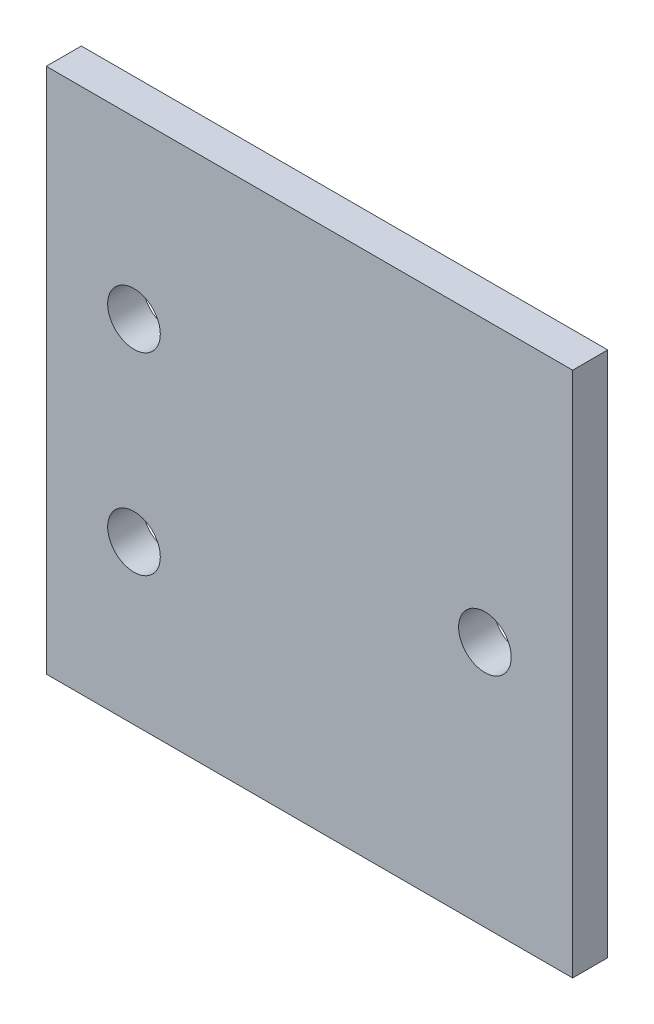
ISO-10303-21;
HEADER;
FILE_DESCRIPTION(('STEP AP214'),'2;1');
FILE_NAME('part.step','',(''),(''),'','','');
FILE_SCHEMA(('AUTOMOTIVE_DESIGN { 1 0 10303 214 1 1 1 1 }'));
ENDSEC;
DATA;
#1=APPLICATION_CONTEXT('core data for automotive mechanical design processes');
#2=APPLICATION_PROTOCOL_DEFINITION('international standard','automotive_design',2000,#1);
#3=PRODUCT_CONTEXT('',#1,'mechanical');
#4=PRODUCT('Part','Part','',(#3));
#5=PRODUCT_RELATED_PRODUCT_CATEGORY('part','',(#4));
#6=PRODUCT_DEFINITION_FORMATION('','',#4);
#7=PRODUCT_DEFINITION_CONTEXT('part definition',#1,'design');
#8=PRODUCT_DEFINITION('design','',#6,#7);
#9=PRODUCT_DEFINITION_SHAPE('','',#8);
#10=(LENGTH_UNIT() NAMED_UNIT(*) SI_UNIT(.MILLI.,.METRE.));
#11=(NAMED_UNIT(*) PLANE_ANGLE_UNIT() SI_UNIT($,.RADIAN.));
#12=(NAMED_UNIT(*) SI_UNIT($,.STERADIAN.) SOLID_ANGLE_UNIT());
#13=UNCERTAINTY_MEASURE_WITH_UNIT(LENGTH_MEASURE(1.E-05),#10,'distance_accuracy_value','');
#14=(GEOMETRIC_REPRESENTATION_CONTEXT(3) GLOBAL_UNCERTAINTY_ASSIGNED_CONTEXT((#13)) GLOBAL_UNIT_ASSIGNED_CONTEXT((#10,
#11,#12)) REPRESENTATION_CONTEXT('',''));
#15=CARTESIAN_POINT('',(0.,0.,0.));
#16=DIRECTION('',(0.,0.,1.));
#17=DIRECTION('',(1.,0.,0.));
#18=AXIS2_PLACEMENT_3D('',#15,#16,#17);
#19=CARTESIAN_POINT('',(0.,0.,2.));
#20=DIRECTION('',(0.,0.,1.));
#21=DIRECTION('',(1.,0.,0.));
#22=AXIS2_PLACEMENT_3D('',#19,#20,#21);
#23=PLANE('',#22);
#24=CARTESIAN_POINT('',(5.,-20.9721655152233,2.));
#25=DIRECTION('',(0.,0.,1.));
#26=DIRECTION('',(1.,0.,0.));
#27=AXIS2_PLACEMENT_3D('',#24,#25,#26);
#28=CIRCLE('',#27,1.5);
#29=CARTESIAN_POINT('',(6.5,-20.9721655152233,2.));
#30=VERTEX_POINT('',#29);
#31=EDGE_CURVE('E134',#30,#30,#28,.T.);
#32=ORIENTED_EDGE('',*,*,#31,.F.);
#33=EDGE_LOOP('',(#32));
#34=FACE_BOUND('',#33,.T.);
#35=DIRECTION('',(0.,-1.,0.));
#36=VECTOR('',#35,1.);
#37=CARTESIAN_POINT('',(0.,0.,2.));
#38=LINE('',#37,#36);
#39=CARTESIAN_POINT('',(0.,0.,2.));
#40=VERTEX_POINT('',#39);
#41=CARTESIAN_POINT('',(0.,-30.,2.));
#42=VERTEX_POINT('',#41);
#43=EDGE_CURVE('E92',#40,#42,#38,.T.);
#44=ORIENTED_EDGE('',*,*,#43,.T.);
#45=DIRECTION('',(1.,0.,0.));
#46=VECTOR('',#45,1.);
#47=CARTESIAN_POINT('',(0.,-30.,2.));
#48=LINE('',#47,#46);
#49=CARTESIAN_POINT('',(30.,-30.,2.));
#50=VERTEX_POINT('',#49);
#51=EDGE_CURVE('E87',#42,#50,#48,.T.);
#52=ORIENTED_EDGE('',*,*,#51,.T.);
#53=DIRECTION('',(0.,1.,0.));
#54=VECTOR('',#53,1.);
#55=CARTESIAN_POINT('',(30.,0.,2.));
#56=LINE('',#55,#54);
#57=CARTESIAN_POINT('',(30.,0.,2.));
#58=VERTEX_POINT('',#57);
#59=EDGE_CURVE('E90',#50,#58,#56,.T.);
#60=ORIENTED_EDGE('',*,*,#59,.T.);
#61=DIRECTION('',(-1.,0.,0.));
#62=VECTOR('',#61,1.);
#63=CARTESIAN_POINT('',(0.,0.,2.));
#64=LINE('',#63,#62);
#65=EDGE_CURVE('E57',#58,#40,#64,.T.);
#66=ORIENTED_EDGE('',*,*,#65,.T.);
#67=EDGE_LOOP('',(#44,#52,#60,#66));
#68=FACE_BOUND('',#67,.T.);
#69=CARTESIAN_POINT('',(5.,-9.97216551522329,2.));
#70=DIRECTION('',(0.,0.,1.));
#71=DIRECTION('',(1.,0.,0.));
#72=AXIS2_PLACEMENT_3D('',#69,#70,#71);
#73=CIRCLE('',#72,1.5);
#74=CARTESIAN_POINT('',(6.5,-9.97216551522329,2.));
#75=VERTEX_POINT('',#74);
#76=EDGE_CURVE('E112',#75,#75,#73,.T.);
#77=ORIENTED_EDGE('',*,*,#76,.F.);
#78=EDGE_LOOP('',(#77));
#79=FACE_BOUND('',#78,.T.);
#80=CARTESIAN_POINT('',(25.,-15.9243829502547,2.));
#81=DIRECTION('',(0.,0.,1.));
#82=DIRECTION('',(1.,0.,0.));
#83=AXIS2_PLACEMENT_3D('',#80,#81,#82);
#84=CIRCLE('',#83,1.5);
#85=CARTESIAN_POINT('',(26.5,-15.9243829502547,2.));
#86=VERTEX_POINT('',#85);
#87=EDGE_CURVE('E142',#86,#86,#84,.T.);
#88=ORIENTED_EDGE('',*,*,#87,.F.);
#89=EDGE_LOOP('',(#88));
#90=FACE_BOUND('',#89,.T.);
#91=ADVANCED_FACE('F39',(#34,#68,#79,#90),#23,.T.);
#92=CARTESIAN_POINT('',(0.,0.,0.));
#93=DIRECTION('',(0.,0.,1.));
#94=DIRECTION('',(1.,0.,0.));
#95=AXIS2_PLACEMENT_3D('',#92,#93,#94);
#96=PLANE('',#95);
#97=DIRECTION('',(0.,-1.,0.));
#98=VECTOR('',#97,1.);
#99=CARTESIAN_POINT('',(0.,0.,0.));
#100=LINE('',#99,#98);
#101=CARTESIAN_POINT('',(0.,0.,0.));
#102=VERTEX_POINT('',#101);
#103=CARTESIAN_POINT('',(0.,-30.,0.));
#104=VERTEX_POINT('',#103);
#105=EDGE_CURVE('E108',#102,#104,#100,.T.);
#106=ORIENTED_EDGE('',*,*,#105,.F.);
#107=DIRECTION('',(-1.,0.,0.));
#108=VECTOR('',#107,1.);
#109=CARTESIAN_POINT('',(0.,0.,0.));
#110=LINE('',#109,#108);
#111=CARTESIAN_POINT('',(30.,0.,0.));
#112=VERTEX_POINT('',#111);
#113=EDGE_CURVE('E80',#112,#102,#110,.T.);
#114=ORIENTED_EDGE('',*,*,#113,.F.);
#115=DIRECTION('',(0.,1.,0.));
#116=VECTOR('',#115,1.);
#117=CARTESIAN_POINT('',(30.,0.,0.));
#118=LINE('',#117,#116);
#119=CARTESIAN_POINT('',(30.,-30.,0.));
#120=VERTEX_POINT('',#119);
#121=EDGE_CURVE('E74',#120,#112,#118,.T.);
#122=ORIENTED_EDGE('',*,*,#121,.F.);
#123=DIRECTION('',(1.,0.,0.));
#124=VECTOR('',#123,1.);
#125=CARTESIAN_POINT('',(0.,-30.,0.));
#126=LINE('',#125,#124);
#127=EDGE_CURVE('E97',#104,#120,#126,.T.);
#128=ORIENTED_EDGE('',*,*,#127,.F.);
#129=EDGE_LOOP('',(#106,#114,#122,#128));
#130=FACE_BOUND('',#129,.T.);
#131=CARTESIAN_POINT('',(5.,-9.97216551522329,0.));
#132=DIRECTION('',(0.,0.,1.));
#133=DIRECTION('',(1.,0.,0.));
#134=AXIS2_PLACEMENT_3D('',#131,#132,#133);
#135=CIRCLE('',#134,1.5);
#136=CARTESIAN_POINT('',(6.5,-9.97216551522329,0.));
#137=VERTEX_POINT('',#136);
#138=EDGE_CURVE('E130',#137,#137,#135,.T.);
#139=ORIENTED_EDGE('',*,*,#138,.T.);
#140=EDGE_LOOP('',(#139));
#141=FACE_BOUND('',#140,.T.);
#142=CARTESIAN_POINT('',(5.,-20.9721655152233,0.));
#143=DIRECTION('',(0.,0.,1.));
#144=DIRECTION('',(1.,0.,0.));
#145=AXIS2_PLACEMENT_3D('',#142,#143,#144);
#146=CIRCLE('',#145,1.5);
#147=CARTESIAN_POINT('',(6.5,-20.9721655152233,0.));
#148=VERTEX_POINT('',#147);
#149=EDGE_CURVE('E138',#148,#148,#146,.T.);
#150=ORIENTED_EDGE('',*,*,#149,.T.);
#151=EDGE_LOOP('',(#150));
#152=FACE_BOUND('',#151,.T.);
#153=CARTESIAN_POINT('',(25.,-15.9243829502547,0.));
#154=DIRECTION('',(0.,0.,1.));
#155=DIRECTION('',(1.,0.,0.));
#156=AXIS2_PLACEMENT_3D('',#153,#154,#155);
#157=CIRCLE('',#156,1.5);
#158=CARTESIAN_POINT('',(26.5,-15.9243829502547,0.));
#159=VERTEX_POINT('',#158);
#160=EDGE_CURVE('E146',#159,#159,#157,.T.);
#161=ORIENTED_EDGE('',*,*,#160,.T.);
#162=EDGE_LOOP('',(#161));
#163=FACE_BOUND('',#162,.T.);
#164=ADVANCED_FACE('F125',(#130,#141,#152,#163),#96,.F.);
#165=CARTESIAN_POINT('',(0.,0.,2.));
#166=DIRECTION('',(1.,0.,0.));
#167=DIRECTION('',(0.,1.,0.));
#168=AXIS2_PLACEMENT_3D('',#165,#166,#167);
#169=PLANE('',#168);
#170=ORIENTED_EDGE('',*,*,#105,.T.);
#171=DIRECTION('',(0.,0.,-1.));
#172=VECTOR('',#171,1.);
#173=CARTESIAN_POINT('',(0.,-30.,2.));
#174=LINE('',#173,#172);
#175=EDGE_CURVE('E11',#42,#104,#174,.T.);
#176=ORIENTED_EDGE('',*,*,#175,.F.);
#177=ORIENTED_EDGE('',*,*,#43,.F.);
#178=DIRECTION('',(0.,0.,-1.));
#179=VECTOR('',#178,1.);
#180=CARTESIAN_POINT('',(0.,0.,2.));
#181=LINE('',#180,#179);
#182=EDGE_CURVE('E104',#40,#102,#181,.T.);
#183=ORIENTED_EDGE('',*,*,#182,.T.);
#184=EDGE_LOOP('',(#170,#176,#177,#183));
#185=FACE_BOUND('',#184,.T.);
#186=ADVANCED_FACE('F41',(#185),#169,.F.);
#187=CARTESIAN_POINT('',(0.,-30.,2.));
#188=DIRECTION('',(0.,1.,0.));
#189=DIRECTION('',(0.,0.,1.));
#190=AXIS2_PLACEMENT_3D('',#187,#188,#189);
#191=PLANE('',#190);
#192=ORIENTED_EDGE('',*,*,#127,.T.);
#193=DIRECTION('',(0.,0.,-1.));
#194=VECTOR('',#193,1.);
#195=CARTESIAN_POINT('',(30.,-30.,2.));
#196=LINE('',#195,#194);
#197=EDGE_CURVE('E49',#50,#120,#196,.T.);
#198=ORIENTED_EDGE('',*,*,#197,.F.);
#199=ORIENTED_EDGE('',*,*,#51,.F.);
#200=ORIENTED_EDGE('',*,*,#175,.T.);
#201=EDGE_LOOP('',(#192,#198,#199,#200));
#202=FACE_BOUND('',#201,.T.);
#203=ADVANCED_FACE('F96',(#202),#191,.F.);
#204=CARTESIAN_POINT('',(30.,0.,2.));
#205=DIRECTION('',(-1.,0.,0.));
#206=DIRECTION('',(0.,-1.,0.));
#207=AXIS2_PLACEMENT_3D('',#204,#205,#206);
#208=PLANE('',#207);
#209=ORIENTED_EDGE('',*,*,#121,.T.);
#210=DIRECTION('',(0.,0.,-1.));
#211=VECTOR('',#210,1.);
#212=CARTESIAN_POINT('',(30.,0.,2.));
#213=LINE('',#212,#211);
#214=EDGE_CURVE('E99',#58,#112,#213,.T.);
#215=ORIENTED_EDGE('',*,*,#214,.F.);
#216=ORIENTED_EDGE('',*,*,#59,.F.);
#217=ORIENTED_EDGE('',*,*,#197,.T.);
#218=EDGE_LOOP('',(#209,#215,#216,#217));
#219=FACE_BOUND('',#218,.T.);
#220=ADVANCED_FACE('F100',(#219),#208,.F.);
#221=CARTESIAN_POINT('',(0.,0.,2.));
#222=DIRECTION('',(0.,-1.,0.));
#223=DIRECTION('',(0.,0.,-1.));
#224=AXIS2_PLACEMENT_3D('',#221,#222,#223);
#225=PLANE('',#224);
#226=ORIENTED_EDGE('',*,*,#113,.T.);
#227=ORIENTED_EDGE('',*,*,#182,.F.);
#228=ORIENTED_EDGE('',*,*,#65,.F.);
#229=ORIENTED_EDGE('',*,*,#214,.T.);
#230=EDGE_LOOP('',(#226,#227,#228,#229));
#231=FACE_BOUND('',#230,.T.);
#232=ADVANCED_FACE('F122',(#231),#225,.F.);
#233=CARTESIAN_POINT('',(5.,-9.97216551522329,2.));
#234=DIRECTION('',(0.,0.,-1.));
#235=DIRECTION('',(-1.,0.,0.));
#236=AXIS2_PLACEMENT_3D('',#233,#234,#235);
#237=CYLINDRICAL_SURFACE('',#236,1.5);
#238=ORIENTED_EDGE('',*,*,#76,.T.);
#239=EDGE_LOOP('',(#238));
#240=FACE_BOUND('',#239,.T.);
#241=ORIENTED_EDGE('',*,*,#138,.F.);
#242=EDGE_LOOP('',(#241));
#243=FACE_BOUND('',#242,.T.);
#244=ADVANCED_FACE('F166',(#240,#243),#237,.F.);
#245=CARTESIAN_POINT('',(5.,-20.9721655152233,2.));
#246=DIRECTION('',(0.,0.,-1.));
#247=DIRECTION('',(-1.,0.,0.));
#248=AXIS2_PLACEMENT_3D('',#245,#246,#247);
#249=CYLINDRICAL_SURFACE('',#248,1.5);
#250=ORIENTED_EDGE('',*,*,#31,.T.);
#251=EDGE_LOOP('',(#250));
#252=FACE_BOUND('',#251,.T.);
#253=ORIENTED_EDGE('',*,*,#149,.F.);
#254=EDGE_LOOP('',(#253));
#255=FACE_BOUND('',#254,.T.);
#256=ADVANCED_FACE('F212',(#252,#255),#249,.F.);
#257=CARTESIAN_POINT('',(25.,-15.9243829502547,2.));
#258=DIRECTION('',(0.,0.,-1.));
#259=DIRECTION('',(-1.,0.,0.));
#260=AXIS2_PLACEMENT_3D('',#257,#258,#259);
#261=CYLINDRICAL_SURFACE('',#260,1.5);
#262=ORIENTED_EDGE('',*,*,#87,.T.);
#263=EDGE_LOOP('',(#262));
#264=FACE_BOUND('',#263,.T.);
#265=ORIENTED_EDGE('',*,*,#160,.F.);
#266=EDGE_LOOP('',(#265));
#267=FACE_BOUND('',#266,.T.);
#268=ADVANCED_FACE('F154',(#264,#267),#261,.F.);
#269=CLOSED_SHELL('',(#91,#164,#186,#203,#220,#232,#244,#256,#268));
#270=MANIFOLD_SOLID_BREP('B2',#269);
#271=ADVANCED_BREP_SHAPE_REPRESENTATION('',(#18,#270),#14);
#272=SHAPE_DEFINITION_REPRESENTATION(#9,#271);
ENDSEC;
END-ISO-10303-21;
